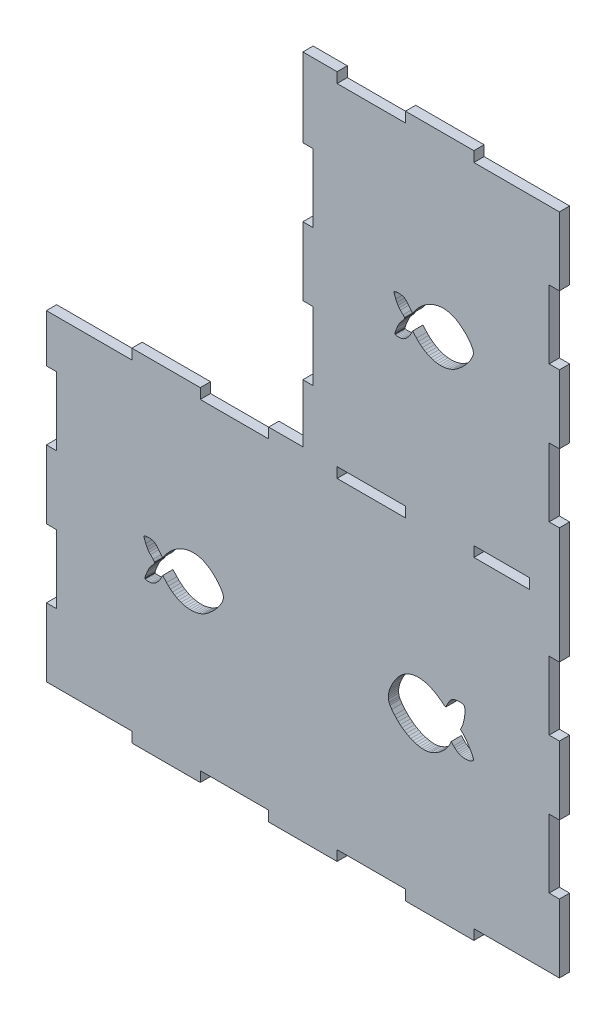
from build123d import *

# Parameters (mm, degrees)
BOSS_EXTRUDE1_DEPTH = 12
SKETCH2_W           = 100
SKETCH2_H           = 12
SKETCH2_W_2         = 80
SKETCH2_W_3         = 12
SKETCH2_H_2         = 80
CUT_EXTRUDE1_DEPTH  = 12
CUT_EXTRUDE3_DEPTH  = 12
CUT_EXTRUDE5_DEPTH  = 12
CUT_EXTRUDE6_DEPTH  = 12
SKETCH7_W           = 80
SKETCH7_H           = 12
SKETCH7_W_2         = 65
CUT_EXTRUDE7_DEPTH  = 1001.071997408


with BuildPart() as part:
    # Sketch1 → Boss-Extrude1 (new body)
    with BuildSketch(Plane.XY):
        Polygon((0, 0), (600, 0), (600, 400), (600, 800), (300, 800), (300, 400), (0, 400), align=None)
    extrude(amount=BOSS_EXTRUDE1_DEPTH)

    # Sketch2 → Cut-Extrude1 (cut)
    with BuildSketch(Plane.XY.offset(12)):
        with Locations((50, 6)):
            Rectangle(SKETCH2_W, SKETCH2_H)
        with Locations((220, 6)):
            Rectangle(SKETCH2_W_2, SKETCH2_H)
        with Locations((380, 6)):
            Rectangle(SKETCH2_W_2, SKETCH2_H)
        with Locations((550, 6)):
            Rectangle(SKETCH2_W, SKETCH2_H)
        with Locations((220, 394)):
            Rectangle(SKETCH2_W_2, SKETCH2_H)
        with Locations((50, 394)):
            Rectangle(SKETCH2_W, SKETCH2_H)
        with Locations((6, 132)):
            Rectangle(SKETCH2_W_3, SKETCH2_H_2)
        with Locations((6, 292)):
            Rectangle(SKETCH2_W_3, SKETCH2_H_2)
        with Locations((594, 292)):
            Rectangle(SKETCH2_W_3, SKETCH2_H_2)
        with Locations((594, 132)):
            Rectangle(SKETCH2_W_3, SKETCH2_H_2)
        with Locations((594, 668)):
            Rectangle(SKETCH2_W_3, SKETCH2_H_2)
        with Locations((594, 508)):
            Rectangle(SKETCH2_W_3, SKETCH2_H_2)
        with Locations((550, 794)):
            Rectangle(SKETCH2_W, SKETCH2_H)
        with Locations((380, 794)):
            Rectangle(SKETCH2_W_2, SKETCH2_H)
        with Locations((306, 508)):
            Rectangle(SKETCH2_W_3, SKETCH2_H_2)
        with Locations((306, 668)):
            Rectangle(SKETCH2_W_3, SKETCH2_H_2)
    extrude(amount=-CUT_EXTRUDE1_DEPTH, mode=Mode.SUBTRACT)

    # Sketch3 → Cut-Extrude3 (cut)
    with BuildSketch(Plane.XY):
        Polygon((497.385248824, 180.364143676), (495.939004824, 179.720790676), (494.183179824, 179.260624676), (492.215481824, 178.983728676), (490.133617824, 178.890188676), (488.035294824, 178.980088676), (486.018217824, 179.253515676), (484.180095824, 179.710552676), (482.618635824, 180.351284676), (481.069321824, 181.289310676), (479.365585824, 182.518483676), (477.714058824, 183.879303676), (476.321369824, 185.212269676), (473.425868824, 188.281062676), (471.901857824, 184.850121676), (471.050985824, 183.134704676), (470.029531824, 181.420551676), (467.536672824, 178.045525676), (464.546874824, 174.824020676), (461.183733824, 171.855015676), (457.570845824, 169.237487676), (453.831805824, 167.070412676), (450.090209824, 165.452769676), (448.257076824, 164.880915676), (446.469652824, 164.483535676), (444.061485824, 164.178088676), (441.592316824, 164.083902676), (439.074092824, 164.195645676), (436.518764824, 164.507982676), (433.938281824, 165.015580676), (431.344593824, 165.713107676), (428.749649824, 166.595229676), (426.165399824, 167.656613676), (423.603792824, 168.891925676), (421.076778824, 170.295831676), (418.596306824, 171.863000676), (416.174325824, 173.588097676), (413.822786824, 175.465790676), (411.553638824, 177.490744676), (409.378830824, 179.657627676), (407.310312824, 181.961105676), (403.995130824, 186.036398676), (401.877558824, 189.148391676), (401.174967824, 190.504058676), (400.660288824, 191.811990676), (400.046011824, 194.542098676), (399.913516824, 196.447372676), (400.016915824, 198.509042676), (400.342060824, 200.700499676), (400.874805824, 202.995137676), (401.601002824, 205.366348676), (402.506504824, 207.787525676), (404.798834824, 212.673349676), (407.638619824, 217.439751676), (410.912682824, 221.873871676), (412.677199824, 223.899808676), (414.507845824, 225.762854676), (416.390471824, 227.436399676), (418.310931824, 228.893839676), (420.588056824, 230.326133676), (422.945571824, 231.526564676), (425.376969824, 232.495825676), (427.875744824, 233.234608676), (430.435388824, 233.743608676), (433.049396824, 234.023516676), (435.711261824, 234.075026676), (438.414476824, 233.898830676), (441.152534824, 233.495621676), (443.918930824, 232.866092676), (446.707156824, 232.010936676), (449.510706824, 230.930845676), (452.323074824, 229.626513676), (455.137752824, 228.098632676), (457.948234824, 226.347896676), (460.748014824, 224.374997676), (466.922283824, 219.767390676), (469.526415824, 224.842798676), (470.928639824, 227.379135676), (472.223687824, 229.229263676), (473.583321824, 230.601685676), (475.179302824, 231.704903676), (476.740350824, 232.414362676), (478.610302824, 232.944464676), (480.653057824, 233.290998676), (482.732517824, 233.449756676), (484.712580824, 233.416530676), (486.457146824, 233.187110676), (487.830115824, 232.757289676), (488.695387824, 232.122858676), (489.027415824, 231.518147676), (489.279651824, 230.692507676), (489.556092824, 228.474751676), (489.547399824, 225.662197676), (489.276259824, 222.447454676), (488.765361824, 219.023132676), (488.037391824, 215.581837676), (487.115039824, 212.316180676), (486.020992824, 209.418769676), (484.437034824, 205.839538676), (486.597942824, 203.856999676), (488.593192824, 201.765782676), (490.762493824, 199.060214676), (492.965227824, 195.969302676), (495.060776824, 192.722048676), (496.908520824, 189.547457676), (498.367842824, 186.674533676), (499.298123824, 184.332280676), (499.520930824, 183.431719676), (499.558744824, 182.749703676), (499.347618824, 182.192853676), (498.867447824, 181.557459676), align=None)
    extrude(amount=CUT_EXTRUDE3_DEPTH, mode=Mode.SUBTRACT)

    # Sketch5 → Cut-Extrude5 (cut)
    with BuildSketch(Plane.XY):
        Polygon((410.201926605, 576.009274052), (411.639250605, 579.166748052), (412.912468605, 581.570006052), (414.132587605, 583.407868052), (415.410611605, 584.869153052), (417.349693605, 586.977529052), (418.622399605, 588.677563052), (419.040667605, 589.642055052), (418.994696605, 590.107784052), (418.706512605, 590.670145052), (417.187068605, 592.407687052), (414.049468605, 595.500529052), (412.538601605, 597.129480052), (411.238735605, 598.930445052), (409.992029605, 601.152795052), (408.640645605, 604.045899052), (406.951645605, 608.282798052), (406.508694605, 609.718941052), (406.430150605, 610.421288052), (406.871992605, 610.840587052), (407.703981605, 611.186286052), (410.195600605, 611.626220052), (413.219412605, 611.679748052), (416.089821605, 611.285530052), (418.048037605, 610.665850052), (419.670073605, 609.676758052), (421.462660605, 607.909160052), (423.932528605, 604.953963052), (428.361249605, 599.472227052), (431.090581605, 603.264942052), (433.548642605, 606.440493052), (436.150007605, 609.345905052), (438.878978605, 611.976072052), (441.719858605, 614.325886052), (444.656951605, 616.390239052), (447.674560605, 618.164025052), (450.756988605, 619.642135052), (453.888539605, 620.819462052), (457.053515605, 621.690899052), (460.236220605, 622.251339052), (463.420956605, 622.495673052), (466.592029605, 622.418796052), (469.733739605, 622.015598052), (472.830391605, 621.280973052), (475.866288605, 620.209814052), (478.825733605, 618.797012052), (482.789360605, 616.333630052), (486.620620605, 613.382265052), (490.187492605, 610.100243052), (493.357957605, 606.644893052), (495.999994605, 603.173541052), (497.981583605, 599.843515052), (498.683454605, 598.280664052), (499.170705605, 596.812142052), (499.426834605, 595.457615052), (499.435339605, 594.236748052), (499.111196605, 592.535380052), (498.496478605, 590.687419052), (497.616515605, 588.721204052), (496.496638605, 586.665075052), (493.638465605, 582.396432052), (490.124603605, 578.108203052), (486.157695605, 574.027102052), (481.940386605, 570.379844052), (479.801158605, 568.789753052), (477.675321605, 567.393142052), (475.588206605, 566.218347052), (473.565143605, 565.293710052), (470.956653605, 564.374104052), (468.322532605, 563.680792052), (465.670272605, 563.211693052), (463.007366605, 562.964727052), (460.341306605, 562.937814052), (457.679583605, 563.128874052), (455.029691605, 563.535827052), (452.399120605, 564.156592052), (449.795364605, 564.989090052), (447.225914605, 566.031240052), (444.698263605, 567.280962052), (442.219903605, 568.736176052), (439.798325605, 570.394802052), (437.441022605, 572.254760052), (435.155487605, 574.313970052), (432.949210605, 576.570351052), (428.377274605, 581.543935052), (427.064394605, 578.815049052), (425.197656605, 575.600540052), (422.870506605, 572.592995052), (420.348980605, 570.094519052), (419.098463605, 569.130589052), (417.899117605, 568.407217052), (416.451629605, 567.820077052), (414.815359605, 567.394737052), (413.105866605, 567.132339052), (411.438709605, 567.034023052), (409.929448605, 567.100934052), (408.693642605, 567.334213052), (407.846851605, 567.735003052), (407.504635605, 568.304445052), (407.687219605, 569.297307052), (408.256632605, 571.080941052), align=None)
    extrude(amount=CUT_EXTRUDE5_DEPTH, mode=Mode.SUBTRACT)

    # Sketch6 → Cut-Extrude6 (cut)
    with BuildSketch(Plane.XY):
        Polygon((117.877011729, 182.231305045), (119.314335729, 185.388779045), (120.587553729, 187.792037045), (121.807672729, 189.629899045), (123.085696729, 191.091184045), (125.024778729, 193.199560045), (126.297484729, 194.899594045), (126.715752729, 195.864086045), (126.669781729, 196.329815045), (126.381597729, 196.892176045), (124.862153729, 198.629718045), (121.724553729, 201.722560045), (120.213686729, 203.351511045), (118.913820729, 205.152476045), (117.667114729, 207.374826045), (116.315730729, 210.267930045), (114.626730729, 214.504829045), (114.183779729, 215.940972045), (114.105235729, 216.643319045), (114.547077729, 217.062618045), (115.379066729, 217.408317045), (117.870685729, 217.848251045), (120.894497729, 217.901779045), (123.764906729, 217.507561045), (125.723122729, 216.887881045), (127.345158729, 215.898789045), (129.137745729, 214.131191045), (131.607613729, 211.175994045), (136.036334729, 205.694258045), (138.765666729, 209.486973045), (141.223727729, 212.662524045), (143.825092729, 215.567936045), (146.554063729, 218.198103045), (149.394943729, 220.547917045), (152.332036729, 222.612270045), (155.349645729, 224.386056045), (158.432073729, 225.864166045), (161.563624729, 227.041493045), (164.728600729, 227.912930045), (167.911305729, 228.473370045), (171.096041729, 228.717704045), (174.267114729, 228.640827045), (177.408824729, 228.237629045), (180.505476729, 227.503004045), (183.541373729, 226.431845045), (186.500818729, 225.019043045), (190.464445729, 222.555661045), (194.295705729, 219.604296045), (197.862577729, 216.322274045), (201.033042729, 212.866924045), (203.675079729, 209.395572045), (205.656668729, 206.065546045), (206.358539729, 204.502695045), (206.845790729, 203.034173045), (207.101919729, 201.679646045), (207.110424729, 200.458779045), (206.786281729, 198.757411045), (206.171563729, 196.909450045), (205.291600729, 194.943235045), (204.171723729, 192.887106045), (201.313550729, 188.618463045), (197.799688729, 184.330234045), (193.832780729, 180.249133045), (189.615471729, 176.601875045), (187.476243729, 175.011784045), (185.350406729, 173.615173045), (183.263291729, 172.440378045), (181.240228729, 171.515741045), (178.631738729, 170.596135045), (175.997617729, 169.902823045), (173.345357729, 169.433724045), (170.682451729, 169.186758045), (168.016391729, 169.159845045), (165.354668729, 169.350905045), (162.704776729, 169.757858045), (160.074205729, 170.378623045), (157.470449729, 171.211121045), (154.900999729, 172.253271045), (152.373348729, 173.502993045), (149.894988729, 174.958207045), (147.473410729, 176.616833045), (145.116107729, 178.476791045), (142.830572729, 180.536001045), (140.624295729, 182.792382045), (136.052359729, 187.765966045), (134.739479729, 185.037080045), (132.872741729, 181.822571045), (130.545591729, 178.815026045), (128.024065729, 176.316550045), (126.773548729, 175.352620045), (125.574202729, 174.629248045), (124.126714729, 174.042108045), (122.490444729, 173.616768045), (120.780951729, 173.354370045), (119.113794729, 173.256054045), (117.604533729, 173.322965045), (116.368727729, 173.556244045), (115.521936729, 173.957034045), (115.179720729, 174.526476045), (115.362304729, 175.519338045), (115.931717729, 177.302972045), align=None)
    extrude(amount=CUT_EXTRUDE6_DEPTH, mode=Mode.SUBTRACT)

    # Sketch7 → Cut-Extrude7 (cut, through all)
    with BuildSketch(Plane.XY.offset(12)):
        with Locations((380, 394)):
            Rectangle(SKETCH7_W, SKETCH7_H)
        with Locations((532.5, 394)):
            Rectangle(SKETCH7_W_2, SKETCH7_H)
    extrude(amount=-CUT_EXTRUDE7_DEPTH, mode=Mode.SUBTRACT)


solid = part.part
